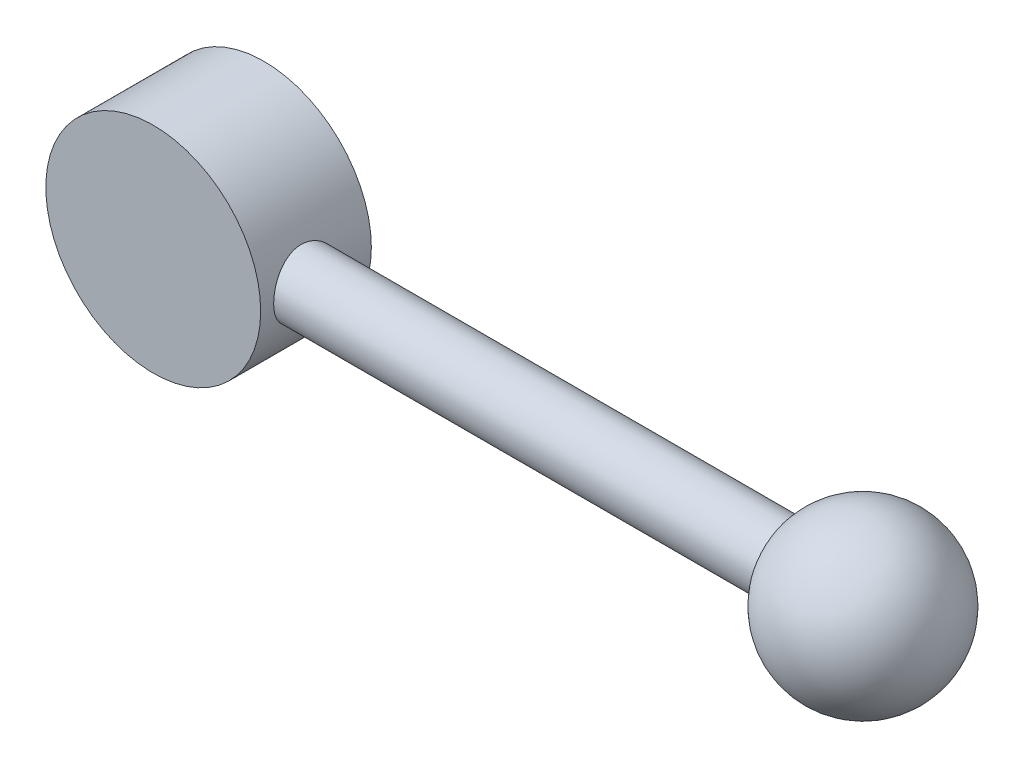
ISO-10303-21;
HEADER;
FILE_DESCRIPTION(('STEP AP214'),'2;1');
FILE_NAME('part.step','',(''),(''),'','','');
FILE_SCHEMA(('AUTOMOTIVE_DESIGN { 1 0 10303 214 1 1 1 1 }'));
ENDSEC;
DATA;
#1=APPLICATION_CONTEXT('core data for automotive mechanical design processes');
#2=APPLICATION_PROTOCOL_DEFINITION('international standard','automotive_design',2000,#1);
#3=PRODUCT_CONTEXT('',#1,'mechanical');
#4=PRODUCT('Part','Part','',(#3));
#5=PRODUCT_RELATED_PRODUCT_CATEGORY('part','',(#4));
#6=PRODUCT_DEFINITION_FORMATION('','',#4);
#7=PRODUCT_DEFINITION_CONTEXT('part definition',#1,'design');
#8=PRODUCT_DEFINITION('design','',#6,#7);
#9=PRODUCT_DEFINITION_SHAPE('','',#8);
#10=(LENGTH_UNIT() NAMED_UNIT(*) SI_UNIT(.MILLI.,.METRE.));
#11=(NAMED_UNIT(*) PLANE_ANGLE_UNIT() SI_UNIT($,.RADIAN.));
#12=(NAMED_UNIT(*) SI_UNIT($,.STERADIAN.) SOLID_ANGLE_UNIT());
#13=UNCERTAINTY_MEASURE_WITH_UNIT(LENGTH_MEASURE(1.E-05),#10,'distance_accuracy_value','');
#14=(GEOMETRIC_REPRESENTATION_CONTEXT(3) GLOBAL_UNCERTAINTY_ASSIGNED_CONTEXT((#13)) GLOBAL_UNIT_ASSIGNED_CONTEXT((#10,
#11,#12)) REPRESENTATION_CONTEXT('',''));
#15=CARTESIAN_POINT('',(0.,0.,0.));
#16=DIRECTION('',(0.,0.,1.));
#17=DIRECTION('',(1.,0.,0.));
#18=AXIS2_PLACEMENT_3D('',#15,#16,#17);
#19=CARTESIAN_POINT('',(0.,0.,0.));
#20=DIRECTION('',(0.,0.,1.));
#21=DIRECTION('',(1.,0.,0.));
#22=AXIS2_PLACEMENT_3D('',#19,#20,#21);
#23=PLANE('',#22);
#24=CARTESIAN_POINT('',(0.,0.,0.));
#25=DIRECTION('',(0.,0.,1.));
#26=DIRECTION('',(1.,0.,0.));
#27=AXIS2_PLACEMENT_3D('',#24,#25,#26);
#28=CIRCLE('',#27,6.75);
#29=CARTESIAN_POINT('',(6.75,0.,0.));
#30=VERTEX_POINT('',#29);
#31=EDGE_CURVE('E34',#30,#30,#28,.T.);
#32=ORIENTED_EDGE('',*,*,#31,.F.);
#33=EDGE_LOOP('',(#32));
#34=FACE_BOUND('',#33,.T.);
#35=CARTESIAN_POINT('',(0.,0.,0.));
#36=DIRECTION('',(0.,0.,-1.));
#37=DIRECTION('',(-1.,0.,0.));
#38=AXIS2_PLACEMENT_3D('',#35,#36,#37);
#39=CIRCLE('',#38,4.);
#40=CARTESIAN_POINT('',(-4.,0.,0.));
#41=VERTEX_POINT('',#40);
#42=EDGE_CURVE('E40',#41,#41,#39,.T.);
#43=ORIENTED_EDGE('',*,*,#42,.F.);
#44=EDGE_LOOP('',(#43));
#45=FACE_BOUND('',#44,.T.);
#46=ADVANCED_FACE('F12',(#34,#45),#23,.F.);
#47=CARTESIAN_POINT('',(0.,0.,40.));
#48=DIRECTION('',(0.,0.,1.));
#49=DIRECTION('',(1.,0.,0.));
#50=AXIS2_PLACEMENT_3D('',#47,#48,#49);
#51=CYLINDRICAL_SURFACE('',#50,6.75);
#52=CARTESIAN_POINT('',(0.,0.,2.));
#53=DIRECTION('',(0.,0.,1.));
#54=DIRECTION('',(1.,0.,0.));
#55=AXIS2_PLACEMENT_3D('',#52,#53,#54);
#56=CIRCLE('',#55,6.75);
#57=CARTESIAN_POINT('',(6.75,0.,2.));
#58=VERTEX_POINT('',#57);
#59=EDGE_CURVE('E8',#58,#58,#56,.T.);
#60=ORIENTED_EDGE('',*,*,#59,.F.);
#61=EDGE_LOOP('',(#60));
#62=FACE_BOUND('',#61,.T.);
#63=ORIENTED_EDGE('',*,*,#31,.T.);
#64=EDGE_LOOP('',(#63));
#65=FACE_BOUND('',#64,.T.);
#66=ADVANCED_FACE('F14',(#62,#65),#51,.T.);
#67=CARTESIAN_POINT('',(6.75,0.,2.));
#68=DIRECTION('',(0.,0.,1.));
#69=DIRECTION('',(1.,0.,0.));
#70=AXIS2_PLACEMENT_3D('',#67,#68,#69);
#71=PLANE('',#70);
#72=CARTESIAN_POINT('',(0.,0.,2.));
#73=DIRECTION('',(0.,0.,1.));
#74=DIRECTION('',(1.,0.,0.));
#75=AXIS2_PLACEMENT_3D('',#72,#73,#74);
#76=CIRCLE('',#75,16.5);
#77=CARTESIAN_POINT('',(16.5,0.,2.));
#78=VERTEX_POINT('',#77);
#79=EDGE_CURVE('E25',#78,#78,#76,.T.);
#80=ORIENTED_EDGE('',*,*,#79,.F.);
#81=EDGE_LOOP('',(#80));
#82=FACE_BOUND('',#81,.T.);
#83=ORIENTED_EDGE('',*,*,#59,.T.);
#84=EDGE_LOOP('',(#83));
#85=FACE_BOUND('',#84,.T.);
#86=ADVANCED_FACE('F71',(#82,#85),#71,.F.);
#87=CARTESIAN_POINT('',(0.,0.,40.));
#88=DIRECTION('',(0.,0.,1.));
#89=DIRECTION('',(1.,0.,0.));
#90=AXIS2_PLACEMENT_3D('',#87,#88,#89);
#91=CYLINDRICAL_SURFACE('',#90,16.5);
#92=CARTESIAN_POINT('',(16.5,0.,7.));
#93=CARTESIAN_POINT('',(16.499997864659,-0.27416656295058,7.00000297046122));
#94=CARTESIAN_POINT('',(16.493101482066,-0.548363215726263,7.02262484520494));
#95=CARTESIAN_POINT('',(16.4662646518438,-1.08876356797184,7.11229452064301));
#96=CARTESIAN_POINT('',(16.446320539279,-1.35496499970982,7.17935480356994));
#97=CARTESIAN_POINT('',(16.3955720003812,-1.87150278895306,7.35545075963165));
#98=CARTESIAN_POINT('',(16.3647837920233,-2.12186218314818,7.4644237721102));
#99=CARTESIAN_POINT('',(16.2955420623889,-2.60075521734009,7.72099257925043));
#100=CARTESIAN_POINT('',(16.2570874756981,-2.82928581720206,7.86859374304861));
#101=CARTESIAN_POINT('',(16.1753529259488,-3.26471495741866,8.20277426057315));
#102=CARTESIAN_POINT('',(16.1319725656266,-3.47088543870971,8.39027763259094));
#103=CARTESIAN_POINT('',(16.0458704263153,-3.84938917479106,8.79697111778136));
#104=CARTESIAN_POINT('',(16.003148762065,-4.02171659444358,9.0161666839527));
#105=CARTESIAN_POINT('',(15.9221353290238,-4.33150150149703,9.48621682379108));
#106=CARTESIAN_POINT('',(15.8839681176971,-4.46806535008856,9.73768383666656));
#107=CARTESIAN_POINT('',(15.8178878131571,-4.69666762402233,10.2613575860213));
#108=CARTESIAN_POINT('',(15.7899722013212,-4.78871698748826,10.5335592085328));
#109=CARTESIAN_POINT('',(15.748602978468,-4.92304273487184,11.0827901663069));
#110=CARTESIAN_POINT('',(15.7347597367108,-4.96666335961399,11.3594605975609));
#111=CARTESIAN_POINT('',(15.7219440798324,-5.00709144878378,11.9165124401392));
#112=CARTESIAN_POINT('',(15.7229679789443,-5.00391051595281,12.1968929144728));
#113=CARTESIAN_POINT('',(15.7394259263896,-4.95188056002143,12.7424297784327));
#114=CARTESIAN_POINT('',(15.7543266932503,-4.90472150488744,13.0077661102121));
#115=CARTESIAN_POINT('',(15.7959958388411,-4.76880670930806,13.5265684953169));
#116=CARTESIAN_POINT('',(15.8227654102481,-4.68004678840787,13.7800333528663));
#117=CARTESIAN_POINT('',(15.8855774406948,-4.46221737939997,14.2720056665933));
#118=CARTESIAN_POINT('',(15.9217437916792,-4.33260397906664,14.5102558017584));
#119=CARTESIAN_POINT('',(15.9992154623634,-4.03712482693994,14.9621878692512));
#120=CARTESIAN_POINT('',(16.0405220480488,-3.87125013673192,15.1758637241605));
#121=CARTESIAN_POINT('',(16.125777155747,-3.49958783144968,15.5821595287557));
#122=CARTESIAN_POINT('',(16.1697632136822,-3.29239951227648,15.7734925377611));
#123=CARTESIAN_POINT('',(16.2538615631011,-2.84832978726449,16.1190003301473));
#124=CARTESIAN_POINT('',(16.2939736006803,-2.61144643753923,16.2731726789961));
#125=CARTESIAN_POINT('',(16.3661834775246,-2.11233821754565,16.540785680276));
#126=CARTESIAN_POINT('',(16.3982236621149,-1.84994861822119,16.6539357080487));
#127=CARTESIAN_POINT('',(16.4502641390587,-1.30866646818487,16.8341173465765));
#128=CARTESIAN_POINT('',(16.4702678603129,-1.02977864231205,16.9011620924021));
#129=CARTESIAN_POINT('',(16.4954369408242,-0.474353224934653,16.985075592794));
#130=CARTESIAN_POINT('',(16.5011177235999,-0.198102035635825,17.0036880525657));
#131=CARTESIAN_POINT('',(16.4985159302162,0.353597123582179,16.99510293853));
#132=CARTESIAN_POINT('',(16.4902352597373,0.629045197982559,16.9679116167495));
#133=CARTESIAN_POINT('',(16.4609787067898,1.16470330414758,16.869898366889));
#134=CARTESIAN_POINT('',(16.4403007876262,1.42511840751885,16.8000997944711));
#135=CARTESIAN_POINT('',(16.388649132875,1.93048096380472,16.6200887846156));
#136=CARTESIAN_POINT('',(16.3576741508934,2.17542653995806,16.5098714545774));
#137=CARTESIAN_POINT('',(16.2877277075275,2.64927766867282,16.2492534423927));
#138=CARTESIAN_POINT('',(16.2485858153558,2.87767261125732,16.097971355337));
#139=CARTESIAN_POINT('',(16.1667951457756,3.30642612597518,15.7605859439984));
#140=CARTESIAN_POINT('',(16.1241454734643,3.50677750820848,15.5744737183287));
#141=CARTESIAN_POINT('',(16.0381606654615,3.88146430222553,15.1645160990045));
#142=CARTESIAN_POINT('',(15.9948588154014,4.05455854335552,14.9395268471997));
#143=CARTESIAN_POINT('',(15.9141467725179,4.36062787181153,14.4627539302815));
#144=CARTESIAN_POINT('',(15.8767364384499,4.49360392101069,14.2109709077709));
#145=CARTESIAN_POINT('',(15.8124706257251,4.71477026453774,13.6884965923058));
#146=CARTESIAN_POINT('',(15.7855679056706,4.80316154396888,13.4178965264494));
#147=CARTESIAN_POINT('',(15.7455304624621,4.93284562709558,12.8646819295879));
#148=CARTESIAN_POINT('',(15.732390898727,4.97415499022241,12.5820716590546));
#149=CARTESIAN_POINT('',(15.7218509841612,5.00736143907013,12.0257720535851));
#150=CARTESIAN_POINT('',(15.7238051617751,5.00128483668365,11.7522143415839));
#151=CARTESIAN_POINT('',(15.7416767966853,4.94474176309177,11.2102140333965));
#152=CARTESIAN_POINT('',(15.7575936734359,4.89427713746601,10.9417712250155));
#153=CARTESIAN_POINT('',(15.8011599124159,4.75171037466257,10.4210074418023));
#154=CARTESIAN_POINT('',(15.8286548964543,4.66015510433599,10.1685228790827));
#155=CARTESIAN_POINT('',(15.8922482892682,4.43843275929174,9.68229661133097));
#156=CARTESIAN_POINT('',(15.9283483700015,4.30825817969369,9.44855856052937));
#157=CARTESIAN_POINT('',(16.0067548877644,4.00734203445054,8.99708364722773));
#158=CARTESIAN_POINT('',(16.0492418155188,3.83527527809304,8.78026142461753));
#159=CARTESIAN_POINT('',(16.1347696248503,3.45783157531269,8.3779118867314));
#160=CARTESIAN_POINT('',(16.1778106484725,3.25244592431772,8.19239277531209));
#161=CARTESIAN_POINT('',(16.2611473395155,2.80676565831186,7.85235596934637));
#162=CARTESIAN_POINT('',(16.301321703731,2.56560775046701,7.69893691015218));
#163=CARTESIAN_POINT('',(16.3729264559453,2.05970384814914,7.43503282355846));
#164=CARTESIAN_POINT('',(16.4043607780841,1.79496853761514,7.32452847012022));
#165=CARTESIAN_POINT('',(16.4523310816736,1.27725626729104,7.15905013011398));
#166=CARTESIAN_POINT('',(16.4700574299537,1.02582323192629,7.09957036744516));
#167=CARTESIAN_POINT('',(16.4938918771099,0.516268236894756,7.02004735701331));
#168=CARTESIAN_POINT('',(16.5000020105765,0.258147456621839,6.999997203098));
#169=CARTESIAN_POINT('',(16.5,0.,7.));
#170=B_SPLINE_CURVE_WITH_KNOTS('',3,(#92,#93,#94,#95,#96,#97,#98,#99,#100,#101,#102,#103,#104,
#105,#106,#107,#108,#109,#110,#111,#112,#113,#114,#115,#116,#117,#118,#119,#120,#121,#122,#123,
#124,#125,#126,#127,#128,#129,#130,#131,#132,#133,#134,#135,#136,#137,#138,#139,#140,#141,#142,
#143,#144,#145,#146,#147,#148,#149,#150,#151,#152,#153,#154,#155,#156,#157,#158,#159,#160,#161,
#162,#163,#164,#165,#166,#167,#168,#169),.UNSPECIFIED.,.T.,.F.,(4,2,2,2,2,2,2,2,2,2,2,2,2,2,2,2,
2,2,2,2,2,2,2,2,2,2,2,2,2,2,2,2,2,2,2,2,2,2,4),(0.,0.82155130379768,1.64333346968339,
2.46389179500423,3.28456423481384,4.12684629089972,4.96927344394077,5.83108565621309,
6.69268599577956,7.52972147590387,8.36654944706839,9.1724896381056,9.97851083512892,
10.7957518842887,11.6131946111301,12.4655059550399,13.3178731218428,14.1761660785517,
15.0342144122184,15.8609136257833,16.6875000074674,17.49497421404,18.302546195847,
19.1290491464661,19.9557636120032,20.8131534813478,21.6705227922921,22.5239918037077,
23.3771605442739,24.194052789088,25.0109110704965,25.8172062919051,26.6236583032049,
27.4600121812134,28.2965849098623,29.1582870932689,30.0196007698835,30.7932856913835,
31.5668350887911),.UNSPECIFIED.);
#171=CARTESIAN_POINT('',(16.5,0.,7.));
#172=VERTEX_POINT('',#171);
#173=EDGE_CURVE('E16',#172,#172,#170,.T.);
#174=ORIENTED_EDGE('',*,*,#173,.T.);
#175=EDGE_LOOP('',(#174));
#176=FACE_BOUND('',#175,.T.);
#177=CARTESIAN_POINT('',(0.,0.,19.));
#178=DIRECTION('',(0.,0.,1.));
#179=DIRECTION('',(1.,0.,0.));
#180=AXIS2_PLACEMENT_3D('',#177,#178,#179);
#181=CIRCLE('',#180,16.5);
#182=CARTESIAN_POINT('',(16.5,0.,19.));
#183=VERTEX_POINT('',#182);
#184=EDGE_CURVE('E29',#183,#183,#181,.T.);
#185=ORIENTED_EDGE('',*,*,#184,.F.);
#186=EDGE_LOOP('',(#185));
#187=FACE_BOUND('',#186,.T.);
#188=ORIENTED_EDGE('',*,*,#79,.T.);
#189=EDGE_LOOP('',(#188));
#190=FACE_BOUND('',#189,.T.);
#191=ADVANCED_FACE('F79',(#176,#187,#190),#91,.T.);
#192=CARTESIAN_POINT('',(16.5,0.,19.));
#193=DIRECTION('',(0.,0.,-1.));
#194=DIRECTION('',(-1.,0.,0.));
#195=AXIS2_PLACEMENT_3D('',#192,#193,#194);
#196=PLANE('',#195);
#197=ORIENTED_EDGE('',*,*,#184,.T.);
#198=EDGE_LOOP('',(#197));
#199=FACE_BOUND('',#198,.T.);
#200=ADVANCED_FACE('F77',(#199),#196,.F.);
#201=CARTESIAN_POINT('',(-30.,0.,12.));
#202=DIRECTION('',(-1.,0.,0.));
#203=DIRECTION('',(0.,0.,1.));
#204=AXIS2_PLACEMENT_3D('',#201,#202,#203);
#205=CYLINDRICAL_SURFACE('',#204,5.);
#206=CARTESIAN_POINT('',(90.5435607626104,0.,12.));
#207=DIRECTION('',(-1.,0.,0.));
#208=DIRECTION('',(0.,0.,1.));
#209=AXIS2_PLACEMENT_3D('',#206,#207,#208);
#210=CIRCLE('',#209,5.);
#211=CARTESIAN_POINT('',(90.5435607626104,0.,17.));
#212=VERTEX_POINT('',#211);
#213=EDGE_CURVE('E37',#212,#212,#210,.T.);
#214=ORIENTED_EDGE('',*,*,#213,.T.);
#215=EDGE_LOOP('',(#214));
#216=FACE_BOUND('',#215,.T.);
#217=ORIENTED_EDGE('',*,*,#173,.F.);
#218=EDGE_LOOP('',(#217));
#219=FACE_BOUND('',#218,.T.);
#220=ADVANCED_FACE('F61',(#216,#219),#205,.T.);
#221=CARTESIAN_POINT('',(102.,0.,12.));
#222=DIRECTION('',(0.,0.,1.));
#223=DIRECTION('',(1.,0.,0.));
#224=AXIS2_PLACEMENT_3D('',#221,#222,#223);
#225=SPHERICAL_SURFACE('',#224,12.5);
#226=CARTESIAN_POINT('',(102.,0.,12.));
#227=DIRECTION('',(-1.,0.,0.));
#228=DIRECTION('',(0.,0.,1.));
#229=AXIS2_PLACEMENT_3D('',#226,#227,#228);
#230=SPHERICAL_SURFACE('',#229,12.5);
#231=ORIENTED_EDGE('',*,*,#213,.F.);
#232=EDGE_LOOP('',(#231));
#233=FACE_BOUND('',#232,.T.);
#234=ADVANCED_FACE('F51',(#233),#230,.T.);
#235=CARTESIAN_POINT('',(0.,0.,0.));
#236=DIRECTION('',(0.,0.,-1.));
#237=DIRECTION('',(-1.,0.,0.));
#238=AXIS2_PLACEMENT_3D('',#235,#236,#237);
#239=CYLINDRICAL_SURFACE('',#238,4.);
#240=ORIENTED_EDGE('',*,*,#42,.T.);
#241=EDGE_LOOP('',(#240));
#242=FACE_BOUND('',#241,.T.);
#243=CARTESIAN_POINT('',(0.,0.,18.));
#244=DIRECTION('',(0.,0.,-1.));
#245=DIRECTION('',(-1.,0.,0.));
#246=AXIS2_PLACEMENT_3D('',#243,#244,#245);
#247=CIRCLE('',#246,4.);
#248=CARTESIAN_POINT('',(-4.,0.,18.));
#249=VERTEX_POINT('',#248);
#250=EDGE_CURVE('E43',#249,#249,#247,.T.);
#251=ORIENTED_EDGE('',*,*,#250,.F.);
#252=EDGE_LOOP('',(#251));
#253=FACE_BOUND('',#252,.T.);
#254=ADVANCED_FACE('F49',(#242,#253),#239,.F.);
#255=CARTESIAN_POINT('',(0.,0.,18.));
#256=DIRECTION('',(0.,0.,-1.));
#257=DIRECTION('',(-1.,0.,0.));
#258=AXIS2_PLACEMENT_3D('',#255,#256,#257);
#259=PLANE('',#258);
#260=ORIENTED_EDGE('',*,*,#250,.T.);
#261=EDGE_LOOP('',(#260));
#262=FACE_BOUND('',#261,.T.);
#263=ADVANCED_FACE('F47',(#262),#259,.T.);
#264=CLOSED_SHELL('',(#46,#66,#86,#191,#200,#220,#234,#254,#263));
#265=MANIFOLD_SOLID_BREP('B1',#264);
#266=ADVANCED_BREP_SHAPE_REPRESENTATION('',(#18,#265),#14);
#267=SHAPE_DEFINITION_REPRESENTATION(#9,#266);
ENDSEC;
END-ISO-10303-21;
